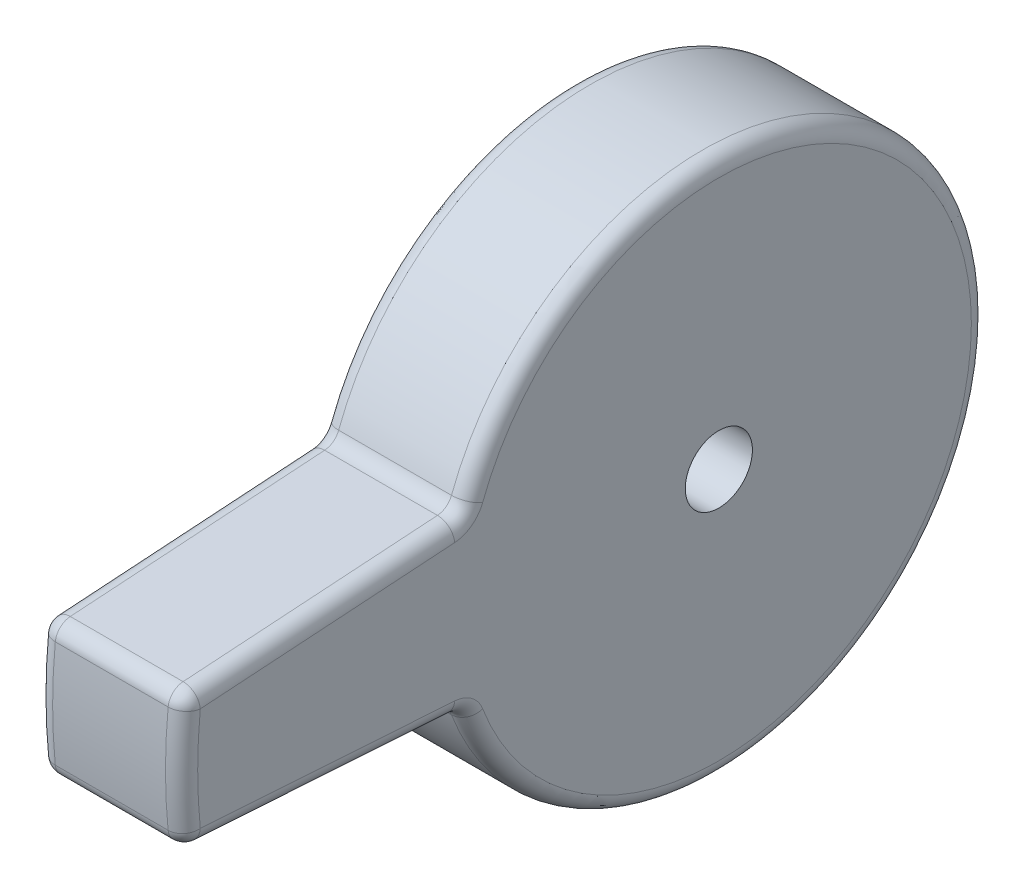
from build123d import *

# Parameters (mm, degrees)
SKETCH12_R      = 1.5875
EXTRUDE11_DEPTH = 3.429
FILLET1_R       = 0.762


with BuildPart() as part:
    # Sketch12 → Extrude11 (new, symmetric)
    with BuildSketch(Plane(origin=(0, 0, 0), x_dir=(0, 0, -1), z_dir=(1, 0, 0))):
        with BuildLine():
            Line((-25.201820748, 3.166738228), (-12.041935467, 4.035070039))
            ThreePointArc((-12.041935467, 4.035070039), (12.7, 0), (-12.041935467, -4.035070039))
            Line((-12.041935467, -4.035070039), (-25.201820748, -3.166738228))
            ThreePointArc((-25.201820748, -3.166738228), (-25.350406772, -1.586466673), (-25.4, 0))
            ThreePointArc((-25.4, 0), (-25.350406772, 1.586466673), (-25.201820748, 3.166738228))
        make_face()
        Circle(SKETCH12_R, mode=Mode.SUBTRACT)
    extrude(amount=EXTRUDE11_DEPTH, both=True)

    # Fillet1
    fillet1_edges = [part.edges().sort_by_distance(p)[0] for p in [
        (3.429, -1.586466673, 25.350406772),
        (3.429, -3.600904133, 18.621878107),
        (3.429, 0, -12.7),
        (-3.429, -3.600904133, 18.621878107),
        (-3.429, -1.586466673, 25.350406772),
        (-3.429, 3.600904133, 18.621878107),
        (-3.429, 0, -12.7),
        (3.429, 3.600904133, 18.621878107),
        (-1.7145, -4.035070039, 12.041935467),
        (-1.7145, -3.166738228, 25.201820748),
        (-1.7145, 3.166738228, 25.201820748),
        (-1.7145, 4.035070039, 12.041935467),
    ]]
    fillet(fillet1_edges, radius=FILLET1_R)


solid = part.part
